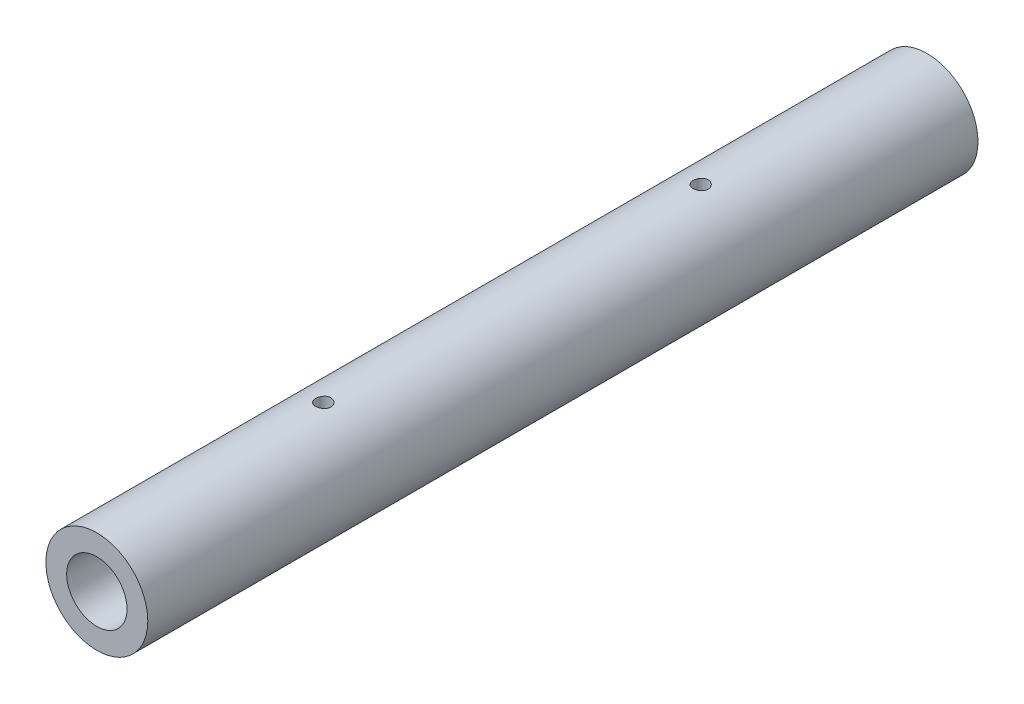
from build123d import *

# Parameters (mm, degrees)
SKETCH1_R           = 13.5
SKETCH1_R_2         = 8
BOSS_EXTRUDE1_DEPTH = 220
SKETCH2_R           = 2
CUT_EXTRUDE1_DEPTH  = 221.826855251


with BuildPart() as part:
    # Sketch1 → Boss-Extrude1 (new body)
    with BuildSketch(Plane.XY):
        Circle(SKETCH1_R)
        Circle(SKETCH1_R_2, mode=Mode.SUBTRACT)
    extrude(amount=-BOSS_EXTRUDE1_DEPTH)

    # Sketch2 → Cut-Extrude1 (cut, through all)
    with BuildSketch(Plane(origin=(0, 0, 0), x_dir=(1, 0, 0), z_dir=(0, 1, 0))):
        with Locations(Location((0, 60, 0), (0, 0, 90))):
            Circle(SKETCH2_R)
        with Locations(Location((0, 160, 0), (0, 0, 90))):
            Circle(SKETCH2_R)
    extrude(amount=CUT_EXTRUDE1_DEPTH, mode=Mode.SUBTRACT)


solid = part.part
